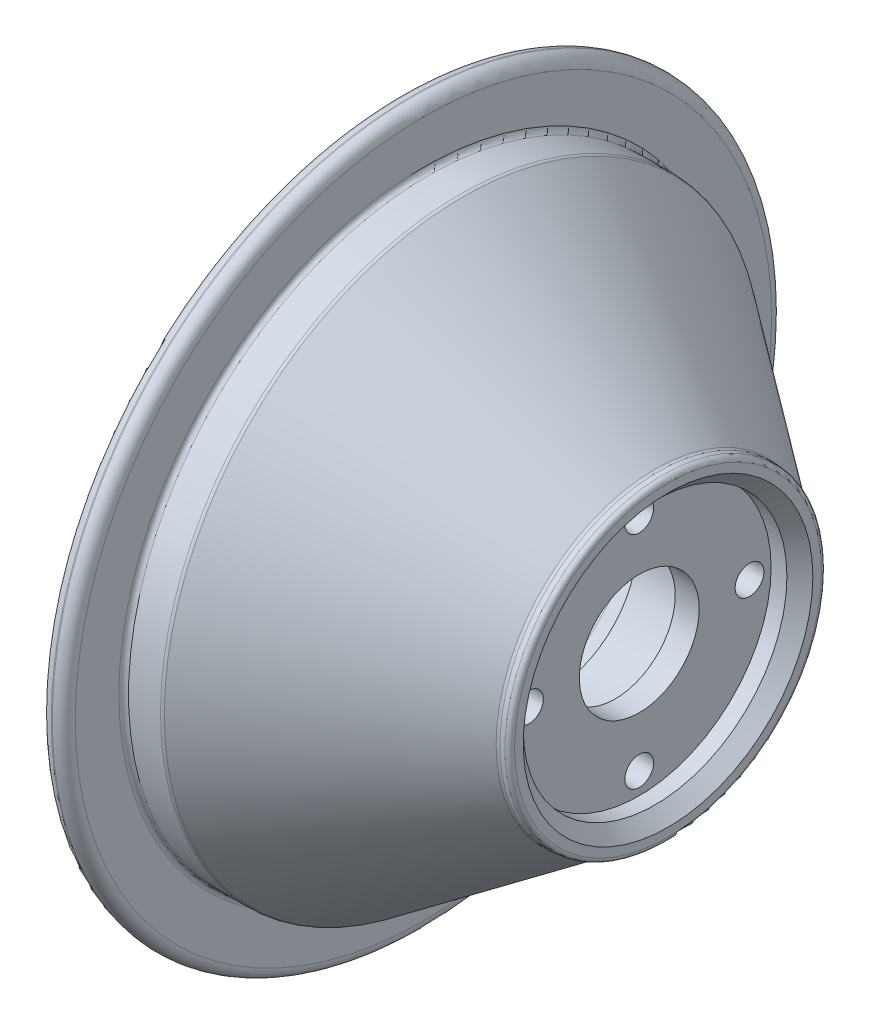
ISO-10303-21;
HEADER;
FILE_DESCRIPTION(('STEP AP214'),'2;1');
FILE_NAME('part.step','',(''),(''),'','','');
FILE_SCHEMA(('AUTOMOTIVE_DESIGN { 1 0 10303 214 1 1 1 1 }'));
ENDSEC;
DATA;
#1=APPLICATION_CONTEXT('core data for automotive mechanical design processes');
#2=APPLICATION_PROTOCOL_DEFINITION('international standard','automotive_design',2000,#1);
#3=PRODUCT_CONTEXT('',#1,'mechanical');
#4=PRODUCT('Part','Part','',(#3));
#5=PRODUCT_RELATED_PRODUCT_CATEGORY('part','',(#4));
#6=PRODUCT_DEFINITION_FORMATION('','',#4);
#7=PRODUCT_DEFINITION_CONTEXT('part definition',#1,'design');
#8=PRODUCT_DEFINITION('design','',#6,#7);
#9=PRODUCT_DEFINITION_SHAPE('','',#8);
#10=(LENGTH_UNIT() NAMED_UNIT(*) SI_UNIT(.MILLI.,.METRE.));
#11=(NAMED_UNIT(*) PLANE_ANGLE_UNIT() SI_UNIT($,.RADIAN.));
#12=(NAMED_UNIT(*) SI_UNIT($,.STERADIAN.) SOLID_ANGLE_UNIT());
#13=UNCERTAINTY_MEASURE_WITH_UNIT(LENGTH_MEASURE(1.E-05),#10,'distance_accuracy_value','');
#14=(GEOMETRIC_REPRESENTATION_CONTEXT(3) GLOBAL_UNCERTAINTY_ASSIGNED_CONTEXT((#13)) GLOBAL_UNIT_ASSIGNED_CONTEXT((#10,
#11,#12)) REPRESENTATION_CONTEXT('',''));
#15=CARTESIAN_POINT('',(0.,0.,0.));
#16=DIRECTION('',(0.,0.,1.));
#17=DIRECTION('',(1.,0.,0.));
#18=AXIS2_PLACEMENT_3D('',#15,#16,#17);
#19=CARTESIAN_POINT('',(0.,0.,0.));
#20=DIRECTION('',(1.,0.,0.));
#21=DIRECTION('',(0.,0.,-1.));
#22=AXIS2_PLACEMENT_3D('',#19,#20,#21);
#23=CYLINDRICAL_SURFACE('',#22,33.);
#24=CARTESIAN_POINT('',(-1.,0.,0.));
#25=DIRECTION('',(1.,0.,0.));
#26=DIRECTION('',(0.,0.,-1.));
#27=AXIS2_PLACEMENT_3D('',#24,#25,#26);
#28=CIRCLE('',#27,33.);
#29=CARTESIAN_POINT('',(-1.,0.,-33.));
#30=VERTEX_POINT('',#29);
#31=EDGE_CURVE('E76',#30,#30,#28,.F.);
#32=ORIENTED_EDGE('',*,*,#31,.T.);
#33=EDGE_LOOP('',(#32));
#34=FACE_BOUND('',#33,.T.);
#35=CARTESIAN_POINT('',(-2.07181364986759,0.,0.));
#36=DIRECTION('',(1.,0.,0.));
#37=DIRECTION('',(0.,0.,-1.));
#38=AXIS2_PLACEMENT_3D('',#35,#36,#37);
#39=CIRCLE('',#38,33.);
#40=CARTESIAN_POINT('',(-2.07181364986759,0.,-33.));
#41=VERTEX_POINT('',#40);
#42=EDGE_CURVE('E79',#41,#41,#39,.T.);
#43=ORIENTED_EDGE('',*,*,#42,.T.);
#44=EDGE_LOOP('',(#43));
#45=FACE_BOUND('',#44,.T.);
#46=ADVANCED_FACE('F30',(#34,#45),#23,.T.);
#47=CARTESIAN_POINT('',(0.,30.2,0.));
#48=DIRECTION('',(1.,0.,0.));
#49=DIRECTION('',(0.,0.,-1.));
#50=AXIS2_PLACEMENT_3D('',#47,#48,#49);
#51=PLANE('',#50);
#52=CARTESIAN_POINT('',(0.,0.,0.));
#53=DIRECTION('',(1.,0.,0.));
#54=DIRECTION('',(0.,0.,-1.));
#55=AXIS2_PLACEMENT_3D('',#52,#53,#54);
#56=CIRCLE('',#55,32.);
#57=CARTESIAN_POINT('',(0.,0.,-32.));
#58=VERTEX_POINT('',#57);
#59=EDGE_CURVE('E82',#58,#58,#56,.T.);
#60=ORIENTED_EDGE('',*,*,#59,.T.);
#61=EDGE_LOOP('',(#60));
#62=FACE_BOUND('',#61,.T.);
#63=CARTESIAN_POINT('',(0.,0.,0.));
#64=DIRECTION('',(1.,0.,0.));
#65=DIRECTION('',(0.,0.,-1.));
#66=AXIS2_PLACEMENT_3D('',#63,#64,#65);
#67=CIRCLE('',#66,30.2);
#68=CARTESIAN_POINT('',(0.,0.,-30.2));
#69=VERTEX_POINT('',#68);
#70=EDGE_CURVE('E97',#69,#69,#67,.T.);
#71=ORIENTED_EDGE('',*,*,#70,.F.);
#72=EDGE_LOOP('',(#71));
#73=FACE_BOUND('',#72,.T.);
#74=ADVANCED_FACE('F208',(#62,#73),#51,.T.);
#75=CARTESIAN_POINT('',(-2.7,0.,0.));
#76=DIRECTION('',(1.,0.,0.));
#77=DIRECTION('',(0.,0.,-1.));
#78=AXIS2_PLACEMENT_3D('',#75,#76,#77);
#79=CONICAL_SURFACE('',#78,27.5,0.78539816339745);
#80=ORIENTED_EDGE('',*,*,#70,.T.);
#81=EDGE_LOOP('',(#80));
#82=FACE_BOUND('',#81,.T.);
#83=CARTESIAN_POINT('',(-2.7,0.,0.));
#84=DIRECTION('',(1.,0.,0.));
#85=DIRECTION('',(0.,0.,-1.));
#86=AXIS2_PLACEMENT_3D('',#83,#84,#85);
#87=CIRCLE('',#86,27.5);
#88=CARTESIAN_POINT('',(-2.7,0.,-27.5));
#89=VERTEX_POINT('',#88);
#90=EDGE_CURVE('E100',#89,#89,#87,.T.);
#91=ORIENTED_EDGE('',*,*,#90,.F.);
#92=EDGE_LOOP('',(#91));
#93=FACE_BOUND('',#92,.T.);
#94=ADVANCED_FACE('F213',(#82,#93),#79,.F.);
#95=CARTESIAN_POINT('',(0.,0.,0.));
#96=DIRECTION('',(1.,0.,0.));
#97=DIRECTION('',(0.,0.,-1.));
#98=AXIS2_PLACEMENT_3D('',#95,#96,#97);
#99=CYLINDRICAL_SURFACE('',#98,27.5);
#100=ORIENTED_EDGE('',*,*,#90,.T.);
#101=EDGE_LOOP('',(#100));
#102=FACE_BOUND('',#101,.T.);
#103=CARTESIAN_POINT('',(-6.,0.,0.));
#104=DIRECTION('',(1.,0.,0.));
#105=DIRECTION('',(0.,0.,-1.));
#106=AXIS2_PLACEMENT_3D('',#103,#104,#105);
#107=CIRCLE('',#106,27.5);
#108=CARTESIAN_POINT('',(-6.,0.,-27.5));
#109=VERTEX_POINT('',#108);
#110=EDGE_CURVE('E103',#109,#109,#107,.T.);
#111=ORIENTED_EDGE('',*,*,#110,.F.);
#112=EDGE_LOOP('',(#111));
#113=FACE_BOUND('',#112,.T.);
#114=ADVANCED_FACE('F343',(#102,#113),#99,.F.);
#115=CARTESIAN_POINT('',(-6.,27.5,0.));
#116=DIRECTION('',(1.,0.,0.));
#117=DIRECTION('',(0.,0.,-1.));
#118=AXIS2_PLACEMENT_3D('',#115,#116,#117);
#119=PLANE('',#118);
#120=CARTESIAN_POINT('',(-6.,2.40912351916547E-13,-23.));
#121=DIRECTION('',(1.,0.,0.));
#122=DIRECTION('',(0.,0.,-1.));
#123=AXIS2_PLACEMENT_3D('',#120,#121,#122);
#124=CIRCLE('',#123,3.);
#125=CARTESIAN_POINT('',(-6.,2.40912351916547E-13,-26.));
#126=VERTEX_POINT('',#125);
#127=EDGE_CURVE('E160',#126,#126,#124,.T.);
#128=ORIENTED_EDGE('',*,*,#127,.F.);
#129=EDGE_LOOP('',(#128));
#130=FACE_BOUND('',#129,.T.);
#131=CARTESIAN_POINT('',(-6.,-23.,-1.60608234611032E-13));
#132=DIRECTION('',(1.,0.,0.));
#133=DIRECTION('',(0.,0.,-1.));
#134=AXIS2_PLACEMENT_3D('',#131,#132,#133);
#135=CIRCLE('',#134,3.);
#136=CARTESIAN_POINT('',(-6.,-23.,-3.00000000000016));
#137=VERTEX_POINT('',#136);
#138=EDGE_CURVE('E154',#137,#137,#135,.T.);
#139=ORIENTED_EDGE('',*,*,#138,.F.);
#140=EDGE_LOOP('',(#139));
#141=FACE_BOUND('',#140,.T.);
#142=CARTESIAN_POINT('',(-6.,0.,23.));
#143=DIRECTION('',(1.,0.,0.));
#144=DIRECTION('',(0.,0.,-1.));
#145=AXIS2_PLACEMENT_3D('',#142,#143,#144);
#146=CIRCLE('',#145,3.);
#147=CARTESIAN_POINT('',(-6.,0.,20.));
#148=VERTEX_POINT('',#147);
#149=EDGE_CURVE('E148',#148,#148,#146,.T.);
#150=ORIENTED_EDGE('',*,*,#149,.F.);
#151=EDGE_LOOP('',(#150));
#152=FACE_BOUND('',#151,.T.);
#153=CARTESIAN_POINT('',(-6.,23.,0.));
#154=DIRECTION('',(1.,0.,0.));
#155=DIRECTION('',(0.,0.,-1.));
#156=AXIS2_PLACEMENT_3D('',#153,#154,#155);
#157=CIRCLE('',#156,3.);
#158=CARTESIAN_POINT('',(-6.,23.,-3.));
#159=VERTEX_POINT('',#158);
#160=EDGE_CURVE('E142',#159,#159,#157,.T.);
#161=ORIENTED_EDGE('',*,*,#160,.F.);
#162=EDGE_LOOP('',(#161));
#163=FACE_BOUND('',#162,.T.);
#164=ORIENTED_EDGE('',*,*,#110,.T.);
#165=EDGE_LOOP('',(#164));
#166=FACE_BOUND('',#165,.T.);
#167=CARTESIAN_POINT('',(-6.,0.,0.));
#168=DIRECTION('',(1.,0.,0.));
#169=DIRECTION('',(0.,0.,-1.));
#170=AXIS2_PLACEMENT_3D('',#167,#168,#169);
#171=CIRCLE('',#170,12.5);
#172=CARTESIAN_POINT('',(-6.,0.,-12.5));
#173=VERTEX_POINT('',#172);
#174=EDGE_CURVE('E106',#173,#173,#171,.T.);
#175=ORIENTED_EDGE('',*,*,#174,.F.);
#176=EDGE_LOOP('',(#175));
#177=FACE_BOUND('',#176,.T.);
#178=ADVANCED_FACE('F340',(#130,#141,#152,#163,#166,#177),#119,.T.);
#179=CARTESIAN_POINT('',(0.,0.,0.));
#180=DIRECTION('',(1.,0.,0.));
#181=DIRECTION('',(0.,0.,-1.));
#182=AXIS2_PLACEMENT_3D('',#179,#180,#181);
#183=CYLINDRICAL_SURFACE('',#182,12.5);
#184=ORIENTED_EDGE('',*,*,#174,.T.);
#185=EDGE_LOOP('',(#184));
#186=FACE_BOUND('',#185,.T.);
#187=CARTESIAN_POINT('',(-11.,0.,0.));
#188=DIRECTION('',(1.,0.,0.));
#189=DIRECTION('',(0.,0.,-1.));
#190=AXIS2_PLACEMENT_3D('',#187,#188,#189);
#191=CIRCLE('',#190,12.5);
#192=CARTESIAN_POINT('',(-11.,0.,-12.5));
#193=VERTEX_POINT('',#192);
#194=EDGE_CURVE('E109',#193,#193,#191,.T.);
#195=ORIENTED_EDGE('',*,*,#194,.F.);
#196=EDGE_LOOP('',(#195));
#197=FACE_BOUND('',#196,.T.);
#198=ADVANCED_FACE('F204',(#186,#197),#183,.F.);
#199=CARTESIAN_POINT('',(-11.,17.5,0.));
#200=DIRECTION('',(-1.,0.,0.));
#201=DIRECTION('',(0.,0.,1.));
#202=AXIS2_PLACEMENT_3D('',#199,#200,#201);
#203=PLANE('',#202);
#204=ORIENTED_EDGE('',*,*,#194,.T.);
#205=EDGE_LOOP('',(#204));
#206=FACE_BOUND('',#205,.T.);
#207=CARTESIAN_POINT('',(-11.,0.,0.));
#208=DIRECTION('',(1.,0.,0.));
#209=DIRECTION('',(0.,0.,-1.));
#210=AXIS2_PLACEMENT_3D('',#207,#208,#209);
#211=CIRCLE('',#210,17.5);
#212=CARTESIAN_POINT('',(-11.,0.,-17.5));
#213=VERTEX_POINT('',#212);
#214=EDGE_CURVE('E112',#213,#213,#211,.T.);
#215=ORIENTED_EDGE('',*,*,#214,.F.);
#216=EDGE_LOOP('',(#215));
#217=FACE_BOUND('',#216,.T.);
#218=ADVANCED_FACE('F198',(#206,#217),#203,.T.);
#219=CARTESIAN_POINT('',(0.,0.,0.));
#220=DIRECTION('',(1.,0.,0.));
#221=DIRECTION('',(0.,0.,-1.));
#222=AXIS2_PLACEMENT_3D('',#219,#220,#221);
#223=CYLINDRICAL_SURFACE('',#222,17.5);
#224=ORIENTED_EDGE('',*,*,#214,.T.);
#225=EDGE_LOOP('',(#224));
#226=FACE_BOUND('',#225,.T.);
#227=CARTESIAN_POINT('',(-24.,0.,0.));
#228=DIRECTION('',(1.,0.,0.));
#229=DIRECTION('',(0.,0.,-1.));
#230=AXIS2_PLACEMENT_3D('',#227,#228,#229);
#231=CIRCLE('',#230,17.5);
#232=CARTESIAN_POINT('',(-24.,0.,-17.5));
#233=VERTEX_POINT('',#232);
#234=EDGE_CURVE('E115',#233,#233,#231,.T.);
#235=ORIENTED_EDGE('',*,*,#234,.F.);
#236=EDGE_LOOP('',(#235));
#237=FACE_BOUND('',#236,.T.);
#238=ADVANCED_FACE('F187',(#226,#237),#223,.F.);
#239=CARTESIAN_POINT('',(-24.,17.5,0.));
#240=DIRECTION('',(-1.,0.,0.));
#241=DIRECTION('',(0.,0.,1.));
#242=AXIS2_PLACEMENT_3D('',#239,#240,#241);
#243=PLANE('',#242);
#244=CARTESIAN_POINT('',(-24.,2.40912351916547E-13,-23.));
#245=DIRECTION('',(-1.,0.,0.));
#246=DIRECTION('',(0.,0.,1.));
#247=AXIS2_PLACEMENT_3D('',#244,#245,#246);
#248=CIRCLE('',#247,4.5);
#249=CARTESIAN_POINT('',(-24.,2.40912351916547E-13,-18.5));
#250=VERTEX_POINT('',#249);
#251=EDGE_CURVE('E139',#250,#250,#248,.T.);
#252=ORIENTED_EDGE('',*,*,#251,.F.);
#253=EDGE_LOOP('',(#252));
#254=FACE_BOUND('',#253,.T.);
#255=CARTESIAN_POINT('',(-24.,-23.,-1.60608234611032E-13));
#256=DIRECTION('',(-1.,0.,0.));
#257=DIRECTION('',(0.,0.,1.));
#258=AXIS2_PLACEMENT_3D('',#255,#256,#257);
#259=CIRCLE('',#258,4.5);
#260=CARTESIAN_POINT('',(-24.,-23.,4.49999999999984));
#261=VERTEX_POINT('',#260);
#262=EDGE_CURVE('E133',#261,#261,#259,.T.);
#263=ORIENTED_EDGE('',*,*,#262,.F.);
#264=EDGE_LOOP('',(#263));
#265=FACE_BOUND('',#264,.T.);
#266=CARTESIAN_POINT('',(-24.,0.,23.));
#267=DIRECTION('',(-1.,0.,0.));
#268=DIRECTION('',(0.,0.,1.));
#269=AXIS2_PLACEMENT_3D('',#266,#267,#268);
#270=CIRCLE('',#269,4.5);
#271=CARTESIAN_POINT('',(-24.,0.,27.5));
#272=VERTEX_POINT('',#271);
#273=EDGE_CURVE('E127',#272,#272,#270,.T.);
#274=ORIENTED_EDGE('',*,*,#273,.F.);
#275=EDGE_LOOP('',(#274));
#276=FACE_BOUND('',#275,.T.);
#277=CARTESIAN_POINT('',(-24.,23.,0.));
#278=DIRECTION('',(-1.,0.,0.));
#279=DIRECTION('',(0.,0.,1.));
#280=AXIS2_PLACEMENT_3D('',#277,#278,#279);
#281=CIRCLE('',#280,4.5);
#282=CARTESIAN_POINT('',(-24.,23.,4.5));
#283=VERTEX_POINT('',#282);
#284=EDGE_CURVE('E121',#283,#283,#281,.T.);
#285=ORIENTED_EDGE('',*,*,#284,.F.);
#286=EDGE_LOOP('',(#285));
#287=FACE_BOUND('',#286,.T.);
#288=CARTESIAN_POINT('',(-24.,0.,0.));
#289=DIRECTION('',(-1.,0.,0.));
#290=DIRECTION('',(0.,0.,1.));
#291=AXIS2_PLACEMENT_3D('',#288,#289,#290);
#292=CIRCLE('',#291,29.572885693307);
#293=CARTESIAN_POINT('',(-24.,0.,29.572885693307));
#294=VERTEX_POINT('',#293);
#295=EDGE_CURVE('E10',#294,#294,#292,.T.);
#296=ORIENTED_EDGE('',*,*,#295,.T.);
#297=EDGE_LOOP('',(#296));
#298=FACE_BOUND('',#297,.T.);
#299=ORIENTED_EDGE('',*,*,#234,.T.);
#300=EDGE_LOOP('',(#299));
#301=FACE_BOUND('',#300,.T.);
#302=ADVANCED_FACE('F183',(#254,#265,#276,#287,#298,#301),#243,.T.);
#303=CARTESIAN_POINT('',(-18.,0.,0.));
#304=DIRECTION('',(1.,0.,0.));
#305=DIRECTION('',(0.,0.,-1.));
#306=AXIS2_PLACEMENT_3D('',#303,#304,#305);
#307=CONICAL_SURFACE('',#306,38.156096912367,0.942477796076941);
#308=CARTESIAN_POINT('',(-18.5877852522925,0.,0.));
#309=DIRECTION('',(1.,0.,0.));
#310=DIRECTION('',(0.,0.,-1.));
#311=AXIS2_PLACEMENT_3D('',#308,#309,#310);
#312=CIRCLE('',#311,37.347079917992);
#313=CARTESIAN_POINT('',(-18.5877852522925,0.,-37.347079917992));
#314=VERTEX_POINT('',#313);
#315=EDGE_CURVE('E36',#314,#314,#312,.F.);
#316=ORIENTED_EDGE('',*,*,#315,.T.);
#317=EDGE_LOOP('',(#316));
#318=FACE_BOUND('',#317,.T.);
#319=CARTESIAN_POINT('',(-23.809016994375,0.,0.));
#320=DIRECTION('',(-1.,0.,0.));
#321=DIRECTION('',(0.,0.,1.));
#322=AXIS2_PLACEMENT_3D('',#319,#320,#321);
#323=CIRCLE('',#322,30.1606709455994);
#324=CARTESIAN_POINT('',(-23.809016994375,0.,30.1606709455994));
#325=VERTEX_POINT('',#324);
#326=EDGE_CURVE('E40',#325,#325,#323,.F.);
#327=ORIENTED_EDGE('',*,*,#326,.T.);
#328=EDGE_LOOP('',(#327));
#329=FACE_BOUND('',#328,.T.);
#330=ADVANCED_FACE('F186',(#318,#329),#307,.T.);
#331=CARTESIAN_POINT('',(-44.6245984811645,0.,0.));
#332=DIRECTION('',(-1.,0.,0.));
#333=DIRECTION('',(0.,0.,1.));
#334=AXIS2_PLACEMENT_3D('',#331,#332,#333);
#335=CONICAL_SURFACE('',#334,57.5,0.62831853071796);
#336=CARTESIAN_POINT('',(-44.361732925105,0.,0.));
#337=DIRECTION('',(-1.,0.,0.));
#338=DIRECTION('',(0.,0.,1.));
#339=AXIS2_PLACEMENT_3D('',#336,#337,#338);
#340=CIRCLE('',#339,57.3090169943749);
#341=CARTESIAN_POINT('',(-44.361732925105,0.,57.3090169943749));
#342=VERTEX_POINT('',#341);
#343=EDGE_CURVE('E52',#342,#342,#340,.T.);
#344=ORIENTED_EDGE('',*,*,#343,.T.);
#345=EDGE_LOOP('',(#344));
#346=FACE_BOUND('',#345,.T.);
#347=CARTESIAN_POINT('',(-18.8090169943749,0.,0.));
#348=DIRECTION('',(-1.,0.,0.));
#349=DIRECTION('',(0.,0.,1.));
#350=AXIS2_PLACEMENT_3D('',#347,#348,#349);
#351=CIRCLE('',#350,38.7438821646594);
#352=CARTESIAN_POINT('',(-18.8090169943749,0.,38.7438821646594));
#353=VERTEX_POINT('',#352);
#354=EDGE_CURVE('E55',#353,#353,#351,.F.);
#355=ORIENTED_EDGE('',*,*,#354,.T.);
#356=EDGE_LOOP('',(#355));
#357=FACE_BOUND('',#356,.T.);
#358=ADVANCED_FACE('F284',(#346,#357),#335,.F.);
#359=CARTESIAN_POINT('',(0.,0.,0.));
#360=DIRECTION('',(1.,0.,0.));
#361=DIRECTION('',(0.,0.,-1.));
#362=AXIS2_PLACEMENT_3D('',#359,#360,#361);
#363=CYLINDRICAL_SURFACE('',#362,57.5);
#364=CARTESIAN_POINT('',(-55.,0.,0.));
#365=DIRECTION('',(-1.,0.,0.));
#366=DIRECTION('',(0.,0.,1.));
#367=AXIS2_PLACEMENT_3D('',#364,#365,#366);
#368=CIRCLE('',#367,57.5);
#369=CARTESIAN_POINT('',(-55.,0.,57.5));
#370=VERTEX_POINT('',#369);
#371=EDGE_CURVE('E58',#370,#370,#368,.T.);
#372=ORIENTED_EDGE('',*,*,#371,.T.);
#373=EDGE_LOOP('',(#372));
#374=FACE_BOUND('',#373,.T.);
#375=CARTESIAN_POINT('',(-44.9495181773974,0.,0.));
#376=DIRECTION('',(1.,0.,0.));
#377=DIRECTION('',(0.,0.,-1.));
#378=AXIS2_PLACEMENT_3D('',#375,#376,#377);
#379=CIRCLE('',#378,57.5);
#380=CARTESIAN_POINT('',(-44.9495181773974,0.,-57.5));
#381=VERTEX_POINT('',#380);
#382=EDGE_CURVE('E61',#381,#381,#379,.T.);
#383=ORIENTED_EDGE('',*,*,#382,.T.);
#384=EDGE_LOOP('',(#383));
#385=FACE_BOUND('',#384,.T.);
#386=ADVANCED_FACE('F280',(#374,#385),#363,.F.);
#387=CARTESIAN_POINT('',(-56.,75.,0.));
#388=DIRECTION('',(-1.,0.,0.));
#389=DIRECTION('',(0.,0.,1.));
#390=AXIS2_PLACEMENT_3D('',#387,#388,#389);
#391=PLANE('',#390);
#392=CARTESIAN_POINT('',(-56.,0.,0.));
#393=DIRECTION('',(-1.,0.,0.));
#394=DIRECTION('',(0.,0.,1.));
#395=AXIS2_PLACEMENT_3D('',#392,#393,#394);
#396=CIRCLE('',#395,58.5);
#397=CARTESIAN_POINT('',(-56.,0.,58.5));
#398=VERTEX_POINT('',#397);
#399=EDGE_CURVE('E64',#398,#398,#396,.F.);
#400=ORIENTED_EDGE('',*,*,#399,.T.);
#401=EDGE_LOOP('',(#400));
#402=FACE_BOUND('',#401,.T.);
#403=CARTESIAN_POINT('',(-56.,0.,0.));
#404=DIRECTION('',(-1.,0.,0.));
#405=DIRECTION('',(0.,0.,1.));
#406=AXIS2_PLACEMENT_3D('',#403,#404,#405);
#407=CIRCLE('',#406,72.6);
#408=CARTESIAN_POINT('',(-56.,0.,72.6));
#409=VERTEX_POINT('',#408);
#410=EDGE_CURVE('E88',#409,#409,#407,.T.);
#411=ORIENTED_EDGE('',*,*,#410,.T.);
#412=EDGE_LOOP('',(#411));
#413=FACE_BOUND('',#412,.T.);
#414=ADVANCED_FACE('F276',(#402,#413),#391,.T.);
#415=CARTESIAN_POINT('',(0.,0.,0.));
#416=DIRECTION('',(1.,0.,0.));
#417=DIRECTION('',(0.,0.,-1.));
#418=AXIS2_PLACEMENT_3D('',#415,#416,#417);
#419=CYLINDRICAL_SURFACE('',#418,75.);
#420=CARTESIAN_POINT('',(-53.6,0.,0.));
#421=DIRECTION('',(-1.,0.,0.));
#422=DIRECTION('',(0.,0.,1.));
#423=AXIS2_PLACEMENT_3D('',#420,#421,#422);
#424=CIRCLE('',#423,75.);
#425=CARTESIAN_POINT('',(-53.6,0.,75.));
#426=VERTEX_POINT('',#425);
#427=EDGE_CURVE('E91',#426,#426,#424,.F.);
#428=ORIENTED_EDGE('',*,*,#427,.T.);
#429=EDGE_LOOP('',(#428));
#430=FACE_BOUND('',#429,.T.);
#431=CARTESIAN_POINT('',(-53.4,0.,0.));
#432=DIRECTION('',(1.,0.,0.));
#433=DIRECTION('',(0.,0.,-1.));
#434=AXIS2_PLACEMENT_3D('',#431,#432,#433);
#435=CIRCLE('',#434,75.);
#436=CARTESIAN_POINT('',(-53.4,0.,-75.));
#437=VERTEX_POINT('',#436);
#438=EDGE_CURVE('E94',#437,#437,#435,.F.);
#439=ORIENTED_EDGE('',*,*,#438,.T.);
#440=EDGE_LOOP('',(#439));
#441=FACE_BOUND('',#440,.T.);
#442=ADVANCED_FACE('F272',(#430,#441),#419,.T.);
#443=CARTESIAN_POINT('',(-51.,62.5,0.));
#444=DIRECTION('',(1.,0.,0.));
#445=DIRECTION('',(0.,0.,-1.));
#446=AXIS2_PLACEMENT_3D('',#443,#444,#445);
#447=PLANE('',#446);
#448=CARTESIAN_POINT('',(-51.,0.,0.));
#449=DIRECTION('',(1.,0.,0.));
#450=DIRECTION('',(0.,0.,-1.));
#451=AXIS2_PLACEMENT_3D('',#448,#449,#450);
#452=CIRCLE('',#451,63.5);
#453=CARTESIAN_POINT('',(-51.,0.,-63.5));
#454=VERTEX_POINT('',#453);
#455=EDGE_CURVE('E67',#454,#454,#452,.F.);
#456=ORIENTED_EDGE('',*,*,#455,.T.);
#457=EDGE_LOOP('',(#456));
#458=FACE_BOUND('',#457,.T.);
#459=CARTESIAN_POINT('',(-51.,0.,0.));
#460=DIRECTION('',(1.,0.,0.));
#461=DIRECTION('',(0.,0.,-1.));
#462=AXIS2_PLACEMENT_3D('',#459,#460,#461);
#463=CIRCLE('',#462,72.6);
#464=CARTESIAN_POINT('',(-51.,0.,-72.6));
#465=VERTEX_POINT('',#464);
#466=EDGE_CURVE('E85',#465,#465,#463,.T.);
#467=ORIENTED_EDGE('',*,*,#466,.T.);
#468=EDGE_LOOP('',(#467));
#469=FACE_BOUND('',#468,.T.);
#470=ADVANCED_FACE('F268',(#458,#469),#447,.T.);
#471=CARTESIAN_POINT('',(0.,0.,0.));
#472=DIRECTION('',(1.,0.,0.));
#473=DIRECTION('',(0.,0.,-1.));
#474=AXIS2_PLACEMENT_3D('',#471,#472,#473);
#475=CYLINDRICAL_SURFACE('',#474,62.5);
#476=CARTESIAN_POINT('',(-50.,0.,0.));
#477=DIRECTION('',(1.,0.,0.));
#478=DIRECTION('',(0.,0.,-1.));
#479=AXIS2_PLACEMENT_3D('',#476,#477,#478);
#480=CIRCLE('',#479,62.5);
#481=CARTESIAN_POINT('',(-50.,0.,-62.5));
#482=VERTEX_POINT('',#481);
#483=EDGE_CURVE('E70',#482,#482,#480,.T.);
#484=ORIENTED_EDGE('',*,*,#483,.T.);
#485=EDGE_LOOP('',(#484));
#486=FACE_BOUND('',#485,.T.);
#487=CARTESIAN_POINT('',(-43.3249196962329,0.,0.));
#488=DIRECTION('',(-1.,0.,0.));
#489=DIRECTION('',(0.,0.,1.));
#490=AXIS2_PLACEMENT_3D('',#487,#488,#489);
#491=CIRCLE('',#490,62.5);
#492=CARTESIAN_POINT('',(-43.3249196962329,0.,62.5));
#493=VERTEX_POINT('',#492);
#494=EDGE_CURVE('E73',#493,#493,#491,.T.);
#495=ORIENTED_EDGE('',*,*,#494,.T.);
#496=EDGE_LOOP('',(#495));
#497=FACE_BOUND('',#496,.T.);
#498=ADVANCED_FACE('F264',(#486,#497),#475,.T.);
#499=CARTESIAN_POINT('',(-2.3967333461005,0.,0.));
#500=DIRECTION('',(-1.,0.,0.));
#501=DIRECTION('',(0.,0.,1.));
#502=AXIS2_PLACEMENT_3D('',#499,#500,#501);
#503=CONICAL_SURFACE('',#502,33.,0.62831853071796);
#504=CARTESIAN_POINT('',(-42.7371344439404,0.,0.));
#505=DIRECTION('',(1.,0.,0.));
#506=DIRECTION('',(0.,0.,-1.));
#507=AXIS2_PLACEMENT_3D('',#504,#505,#506);
#508=CIRCLE('',#507,62.3090169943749);
#509=CARTESIAN_POINT('',(-42.7371344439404,0.,-62.3090169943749));
#510=VERTEX_POINT('',#509);
#511=EDGE_CURVE('E44',#510,#510,#508,.T.);
#512=ORIENTED_EDGE('',*,*,#511,.T.);
#513=EDGE_LOOP('',(#512));
#514=FACE_BOUND('',#513,.T.);
#515=CARTESIAN_POINT('',(-2.65959890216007,0.,0.));
#516=DIRECTION('',(-1.,0.,0.));
#517=DIRECTION('',(0.,0.,1.));
#518=AXIS2_PLACEMENT_3D('',#515,#516,#517);
#519=CIRCLE('',#518,33.1909830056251);
#520=CARTESIAN_POINT('',(-2.65959890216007,0.,33.1909830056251));
#521=VERTEX_POINT('',#520);
#522=EDGE_CURVE('E49',#521,#521,#519,.T.);
#523=ORIENTED_EDGE('',*,*,#522,.T.);
#524=EDGE_LOOP('',(#523));
#525=FACE_BOUND('',#524,.T.);
#526=ADVANCED_FACE('F260',(#514,#525),#503,.T.);
#527=CARTESIAN_POINT('',(-53.6,0.,0.));
#528=DIRECTION('',(-1.,0.,0.));
#529=DIRECTION('',(0.,0.,1.));
#530=AXIS2_PLACEMENT_3D('',#527,#528,#529);
#531=TOROIDAL_SURFACE('',#530,72.6,2.4);
#532=ORIENTED_EDGE('',*,*,#410,.F.);
#533=EDGE_LOOP('',(#532));
#534=FACE_BOUND('',#533,.T.);
#535=ORIENTED_EDGE('',*,*,#427,.F.);
#536=EDGE_LOOP('',(#535));
#537=FACE_BOUND('',#536,.T.);
#538=ADVANCED_FACE('F256',(#534,#537),#531,.T.);
#539=CARTESIAN_POINT('',(-53.4,0.,0.));
#540=DIRECTION('',(1.,0.,0.));
#541=DIRECTION('',(0.,0.,-1.));
#542=AXIS2_PLACEMENT_3D('',#539,#540,#541);
#543=TOROIDAL_SURFACE('',#542,72.6,2.4);
#544=ORIENTED_EDGE('',*,*,#438,.F.);
#545=EDGE_LOOP('',(#544));
#546=FACE_BOUND('',#545,.T.);
#547=ORIENTED_EDGE('',*,*,#466,.F.);
#548=EDGE_LOOP('',(#547));
#549=FACE_BOUND('',#548,.T.);
#550=ADVANCED_FACE('F252',(#546,#549),#543,.T.);
#551=CARTESIAN_POINT('',(-1.,0.,0.));
#552=DIRECTION('',(1.,0.,0.));
#553=DIRECTION('',(0.,0.,-1.));
#554=AXIS2_PLACEMENT_3D('',#551,#552,#553);
#555=TOROIDAL_SURFACE('',#554,32.,1.);
#556=ORIENTED_EDGE('',*,*,#31,.F.);
#557=EDGE_LOOP('',(#556));
#558=FACE_BOUND('',#557,.T.);
#559=ORIENTED_EDGE('',*,*,#59,.F.);
#560=EDGE_LOOP('',(#559));
#561=FACE_BOUND('',#560,.T.);
#562=ADVANCED_FACE('F248',(#558,#561),#555,.T.);
#563=CARTESIAN_POINT('',(-50.,0.,0.));
#564=DIRECTION('',(1.,0.,0.));
#565=DIRECTION('',(0.,0.,-1.));
#566=AXIS2_PLACEMENT_3D('',#563,#564,#565);
#567=TOROIDAL_SURFACE('',#566,63.5,1.);
#568=ORIENTED_EDGE('',*,*,#455,.F.);
#569=EDGE_LOOP('',(#568));
#570=FACE_BOUND('',#569,.T.);
#571=ORIENTED_EDGE('',*,*,#483,.F.);
#572=EDGE_LOOP('',(#571));
#573=FACE_BOUND('',#572,.T.);
#574=ADVANCED_FACE('F244',(#570,#573),#567,.F.);
#575=CARTESIAN_POINT('',(-55.,0.,0.));
#576=DIRECTION('',(-1.,0.,0.));
#577=DIRECTION('',(0.,0.,1.));
#578=AXIS2_PLACEMENT_3D('',#575,#576,#577);
#579=TOROIDAL_SURFACE('',#578,58.5,1.);
#580=ORIENTED_EDGE('',*,*,#371,.F.);
#581=EDGE_LOOP('',(#580));
#582=FACE_BOUND('',#581,.T.);
#583=ORIENTED_EDGE('',*,*,#399,.F.);
#584=EDGE_LOOP('',(#583));
#585=FACE_BOUND('',#584,.T.);
#586=ADVANCED_FACE('F240',(#582,#585),#579,.T.);
#587=CARTESIAN_POINT('',(-44.9495181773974,0.,0.));
#588=DIRECTION('',(1.,0.,0.));
#589=DIRECTION('',(0.,0.,-1.));
#590=AXIS2_PLACEMENT_3D('',#587,#588,#589);
#591=TOROIDAL_SURFACE('',#590,56.5,1.);
#592=ORIENTED_EDGE('',*,*,#343,.F.);
#593=EDGE_LOOP('',(#592));
#594=FACE_BOUND('',#593,.T.);
#595=ORIENTED_EDGE('',*,*,#382,.F.);
#596=EDGE_LOOP('',(#595));
#597=FACE_BOUND('',#596,.T.);
#598=ADVANCED_FACE('F232',(#594,#597),#591,.F.);
#599=CARTESIAN_POINT('',(-43.3249196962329,0.,0.));
#600=DIRECTION('',(-1.,0.,0.));
#601=DIRECTION('',(0.,0.,1.));
#602=AXIS2_PLACEMENT_3D('',#599,#600,#601);
#603=TOROIDAL_SURFACE('',#602,61.5,1.);
#604=ORIENTED_EDGE('',*,*,#494,.F.);
#605=EDGE_LOOP('',(#604));
#606=FACE_BOUND('',#605,.T.);
#607=ORIENTED_EDGE('',*,*,#511,.F.);
#608=EDGE_LOOP('',(#607));
#609=FACE_BOUND('',#608,.T.);
#610=ADVANCED_FACE('F222',(#606,#609),#603,.T.);
#611=CARTESIAN_POINT('',(-2.07181364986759,0.,0.));
#612=DIRECTION('',(1.,0.,0.));
#613=DIRECTION('',(0.,0.,-1.));
#614=AXIS2_PLACEMENT_3D('',#611,#612,#613);
#615=TOROIDAL_SURFACE('',#614,34.,1.);
#616=ORIENTED_EDGE('',*,*,#522,.F.);
#617=EDGE_LOOP('',(#616));
#618=FACE_BOUND('',#617,.T.);
#619=ORIENTED_EDGE('',*,*,#42,.F.);
#620=EDGE_LOOP('',(#619));
#621=FACE_BOUND('',#620,.T.);
#622=ADVANCED_FACE('F219',(#618,#621),#615,.F.);
#623=CARTESIAN_POINT('',(-19.3968022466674,0.,0.));
#624=DIRECTION('',(1.,0.,0.));
#625=DIRECTION('',(0.,0.,-1.));
#626=AXIS2_PLACEMENT_3D('',#623,#624,#625);
#627=TOROIDAL_SURFACE('',#626,37.9348651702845,1.);
#628=ORIENTED_EDGE('',*,*,#315,.F.);
#629=EDGE_LOOP('',(#628));
#630=FACE_BOUND('',#629,.T.);
#631=ORIENTED_EDGE('',*,*,#354,.F.);
#632=EDGE_LOOP('',(#631));
#633=FACE_BOUND('',#632,.T.);
#634=ADVANCED_FACE('F221',(#630,#633),#627,.F.);
#635=CARTESIAN_POINT('',(-23.,0.,0.));
#636=DIRECTION('',(-1.,0.,0.));
#637=DIRECTION('',(0.,0.,1.));
#638=AXIS2_PLACEMENT_3D('',#635,#636,#637);
#639=TOROIDAL_SURFACE('',#638,29.572885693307,1.);
#640=ORIENTED_EDGE('',*,*,#295,.F.);
#641=EDGE_LOOP('',(#640));
#642=FACE_BOUND('',#641,.T.);
#643=ORIENTED_EDGE('',*,*,#326,.F.);
#644=EDGE_LOOP('',(#643));
#645=FACE_BOUND('',#644,.T.);
#646=ADVANCED_FACE('F229',(#642,#645),#639,.T.);
#647=CARTESIAN_POINT('',(-18.,23.,0.));
#648=DIRECTION('',(-1.,0.,0.));
#649=DIRECTION('',(0.,0.,1.));
#650=AXIS2_PLACEMENT_3D('',#647,#648,#649);
#651=CYLINDRICAL_SURFACE('',#650,4.5);
#652=CARTESIAN_POINT('',(-18.,23.,0.));
#653=DIRECTION('',(-1.,0.,0.));
#654=DIRECTION('',(0.,0.,1.));
#655=AXIS2_PLACEMENT_3D('',#652,#653,#654);
#656=CIRCLE('',#655,4.5);
#657=CARTESIAN_POINT('',(-18.,23.,4.5));
#658=VERTEX_POINT('',#657);
#659=EDGE_CURVE('E118',#658,#658,#656,.T.);
#660=ORIENTED_EDGE('',*,*,#659,.F.);
#661=EDGE_LOOP('',(#660));
#662=FACE_BOUND('',#661,.T.);
#663=ORIENTED_EDGE('',*,*,#284,.T.);
#664=EDGE_LOOP('',(#663));
#665=FACE_BOUND('',#664,.T.);
#666=ADVANCED_FACE('F296',(#662,#665),#651,.F.);
#667=CARTESIAN_POINT('',(-18.,23.,0.));
#668=DIRECTION('',(-1.,0.,0.));
#669=DIRECTION('',(0.,0.,1.));
#670=AXIS2_PLACEMENT_3D('',#667,#668,#669);
#671=PLANE('',#670);
#672=CARTESIAN_POINT('',(-18.,23.,0.));
#673=DIRECTION('',(-1.,0.,0.));
#674=DIRECTION('',(0.,0.,1.));
#675=AXIS2_PLACEMENT_3D('',#672,#673,#674);
#676=CIRCLE('',#675,3.);
#677=CARTESIAN_POINT('',(-18.,23.,3.));
#678=VERTEX_POINT('',#677);
#679=EDGE_CURVE('E145',#678,#678,#676,.T.);
#680=ORIENTED_EDGE('',*,*,#679,.F.);
#681=EDGE_LOOP('',(#680));
#682=FACE_BOUND('',#681,.T.);
#683=ORIENTED_EDGE('',*,*,#659,.T.);
#684=EDGE_LOOP('',(#683));
#685=FACE_BOUND('',#684,.T.);
#686=ADVANCED_FACE('F301',(#682,#685),#671,.T.);
#687=CARTESIAN_POINT('',(-18.,0.,23.));
#688=DIRECTION('',(-1.,0.,0.));
#689=DIRECTION('',(0.,0.,1.));
#690=AXIS2_PLACEMENT_3D('',#687,#688,#689);
#691=CYLINDRICAL_SURFACE('',#690,4.5);
#692=CARTESIAN_POINT('',(-18.,0.,23.));
#693=DIRECTION('',(-1.,0.,0.));
#694=DIRECTION('',(0.,0.,1.));
#695=AXIS2_PLACEMENT_3D('',#692,#693,#694);
#696=CIRCLE('',#695,4.5);
#697=CARTESIAN_POINT('',(-18.,0.,27.5));
#698=VERTEX_POINT('',#697);
#699=EDGE_CURVE('E124',#698,#698,#696,.T.);
#700=ORIENTED_EDGE('',*,*,#699,.F.);
#701=EDGE_LOOP('',(#700));
#702=FACE_BOUND('',#701,.T.);
#703=ORIENTED_EDGE('',*,*,#273,.T.);
#704=EDGE_LOOP('',(#703));
#705=FACE_BOUND('',#704,.T.);
#706=ADVANCED_FACE('F307',(#702,#705),#691,.F.);
#707=CARTESIAN_POINT('',(-18.,0.,23.));
#708=DIRECTION('',(-1.,0.,0.));
#709=DIRECTION('',(0.,0.,1.));
#710=AXIS2_PLACEMENT_3D('',#707,#708,#709);
#711=PLANE('',#710);
#712=CARTESIAN_POINT('',(-18.,0.,23.));
#713=DIRECTION('',(-1.,0.,0.));
#714=DIRECTION('',(0.,0.,1.));
#715=AXIS2_PLACEMENT_3D('',#712,#713,#714);
#716=CIRCLE('',#715,3.);
#717=CARTESIAN_POINT('',(-18.,0.,26.));
#718=VERTEX_POINT('',#717);
#719=EDGE_CURVE('E151',#718,#718,#716,.T.);
#720=ORIENTED_EDGE('',*,*,#719,.F.);
#721=EDGE_LOOP('',(#720));
#722=FACE_BOUND('',#721,.T.);
#723=ORIENTED_EDGE('',*,*,#699,.T.);
#724=EDGE_LOOP('',(#723));
#725=FACE_BOUND('',#724,.T.);
#726=ADVANCED_FACE('F311',(#722,#725),#711,.T.);
#727=CARTESIAN_POINT('',(-18.,-23.,-1.60608234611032E-13));
#728=DIRECTION('',(-1.,0.,0.));
#729=DIRECTION('',(0.,0.,1.));
#730=AXIS2_PLACEMENT_3D('',#727,#728,#729);
#731=CYLINDRICAL_SURFACE('',#730,4.5);
#732=CARTESIAN_POINT('',(-18.,-23.,-1.60608234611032E-13));
#733=DIRECTION('',(-1.,0.,0.));
#734=DIRECTION('',(0.,0.,1.));
#735=AXIS2_PLACEMENT_3D('',#732,#733,#734);
#736=CIRCLE('',#735,4.5);
#737=CARTESIAN_POINT('',(-18.,-23.,4.49999999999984));
#738=VERTEX_POINT('',#737);
#739=EDGE_CURVE('E130',#738,#738,#736,.T.);
#740=ORIENTED_EDGE('',*,*,#739,.F.);
#741=EDGE_LOOP('',(#740));
#742=FACE_BOUND('',#741,.T.);
#743=ORIENTED_EDGE('',*,*,#262,.T.);
#744=EDGE_LOOP('',(#743));
#745=FACE_BOUND('',#744,.T.);
#746=ADVANCED_FACE('F315',(#742,#745),#731,.F.);
#747=CARTESIAN_POINT('',(-18.,-23.,-1.60608234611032E-13));
#748=DIRECTION('',(-1.,0.,0.));
#749=DIRECTION('',(0.,0.,1.));
#750=AXIS2_PLACEMENT_3D('',#747,#748,#749);
#751=PLANE('',#750);
#752=CARTESIAN_POINT('',(-18.,-23.,-1.60608234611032E-13));
#753=DIRECTION('',(-1.,0.,0.));
#754=DIRECTION('',(0.,0.,1.));
#755=AXIS2_PLACEMENT_3D('',#752,#753,#754);
#756=CIRCLE('',#755,3.);
#757=CARTESIAN_POINT('',(-18.,-23.,2.99999999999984));
#758=VERTEX_POINT('',#757);
#759=EDGE_CURVE('E157',#758,#758,#756,.T.);
#760=ORIENTED_EDGE('',*,*,#759,.F.);
#761=EDGE_LOOP('',(#760));
#762=FACE_BOUND('',#761,.T.);
#763=ORIENTED_EDGE('',*,*,#739,.T.);
#764=EDGE_LOOP('',(#763));
#765=FACE_BOUND('',#764,.T.);
#766=ADVANCED_FACE('F179',(#762,#765),#751,.T.);
#767=CARTESIAN_POINT('',(-18.,2.40912351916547E-13,-23.));
#768=DIRECTION('',(-1.,0.,0.));
#769=DIRECTION('',(0.,0.,1.));
#770=AXIS2_PLACEMENT_3D('',#767,#768,#769);
#771=CYLINDRICAL_SURFACE('',#770,4.5);
#772=CARTESIAN_POINT('',(-18.,2.40912351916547E-13,-23.));
#773=DIRECTION('',(-1.,0.,0.));
#774=DIRECTION('',(0.,0.,1.));
#775=AXIS2_PLACEMENT_3D('',#772,#773,#774);
#776=CIRCLE('',#775,4.5);
#777=CARTESIAN_POINT('',(-18.,2.40912351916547E-13,-18.5));
#778=VERTEX_POINT('',#777);
#779=EDGE_CURVE('E136',#778,#778,#776,.T.);
#780=ORIENTED_EDGE('',*,*,#779,.F.);
#781=EDGE_LOOP('',(#780));
#782=FACE_BOUND('',#781,.T.);
#783=ORIENTED_EDGE('',*,*,#251,.T.);
#784=EDGE_LOOP('',(#783));
#785=FACE_BOUND('',#784,.T.);
#786=ADVANCED_FACE('F173',(#782,#785),#771,.F.);
#787=CARTESIAN_POINT('',(-18.,2.40912351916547E-13,-23.));
#788=DIRECTION('',(-1.,0.,0.));
#789=DIRECTION('',(0.,0.,1.));
#790=AXIS2_PLACEMENT_3D('',#787,#788,#789);
#791=PLANE('',#790);
#792=CARTESIAN_POINT('',(-18.,2.40912351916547E-13,-23.));
#793=DIRECTION('',(-1.,0.,0.));
#794=DIRECTION('',(0.,0.,1.));
#795=AXIS2_PLACEMENT_3D('',#792,#793,#794);
#796=CIRCLE('',#795,3.);
#797=CARTESIAN_POINT('',(-18.,2.40912351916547E-13,-20.));
#798=VERTEX_POINT('',#797);
#799=EDGE_CURVE('E163',#798,#798,#796,.T.);
#800=ORIENTED_EDGE('',*,*,#799,.F.);
#801=EDGE_LOOP('',(#800));
#802=FACE_BOUND('',#801,.T.);
#803=ORIENTED_EDGE('',*,*,#779,.T.);
#804=EDGE_LOOP('',(#803));
#805=FACE_BOUND('',#804,.T.);
#806=ADVANCED_FACE('F169',(#802,#805),#791,.T.);
#807=CARTESIAN_POINT('',(0.,23.,0.));
#808=DIRECTION('',(-1.,0.,0.));
#809=DIRECTION('',(0.,0.,1.));
#810=AXIS2_PLACEMENT_3D('',#807,#808,#809);
#811=CYLINDRICAL_SURFACE('',#810,3.);
#812=ORIENTED_EDGE('',*,*,#160,.T.);
#813=EDGE_LOOP('',(#812));
#814=FACE_BOUND('',#813,.T.);
#815=ORIENTED_EDGE('',*,*,#679,.T.);
#816=EDGE_LOOP('',(#815));
#817=FACE_BOUND('',#816,.T.);
#818=ADVANCED_FACE('F172',(#814,#817),#811,.F.);
#819=CARTESIAN_POINT('',(0.,0.,23.));
#820=DIRECTION('',(-1.,0.,0.));
#821=DIRECTION('',(0.,0.,1.));
#822=AXIS2_PLACEMENT_3D('',#819,#820,#821);
#823=CYLINDRICAL_SURFACE('',#822,3.);
#824=ORIENTED_EDGE('',*,*,#149,.T.);
#825=EDGE_LOOP('',(#824));
#826=FACE_BOUND('',#825,.T.);
#827=ORIENTED_EDGE('',*,*,#719,.T.);
#828=EDGE_LOOP('',(#827));
#829=FACE_BOUND('',#828,.T.);
#830=ADVANCED_FACE('F325',(#826,#829),#823,.F.);
#831=CARTESIAN_POINT('',(0.,-23.,-1.60608234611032E-13));
#832=DIRECTION('',(-1.,0.,0.));
#833=DIRECTION('',(0.,0.,1.));
#834=AXIS2_PLACEMENT_3D('',#831,#832,#833);
#835=CYLINDRICAL_SURFACE('',#834,3.);
#836=ORIENTED_EDGE('',*,*,#138,.T.);
#837=EDGE_LOOP('',(#836));
#838=FACE_BOUND('',#837,.T.);
#839=ORIENTED_EDGE('',*,*,#759,.T.);
#840=EDGE_LOOP('',(#839));
#841=FACE_BOUND('',#840,.T.);
#842=ADVANCED_FACE('F329',(#838,#841),#835,.F.);
#843=CARTESIAN_POINT('',(0.,2.40912351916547E-13,-23.));
#844=DIRECTION('',(-1.,0.,0.));
#845=DIRECTION('',(0.,0.,1.));
#846=AXIS2_PLACEMENT_3D('',#843,#844,#845);
#847=CYLINDRICAL_SURFACE('',#846,3.);
#848=ORIENTED_EDGE('',*,*,#127,.T.);
#849=EDGE_LOOP('',(#848));
#850=FACE_BOUND('',#849,.T.);
#851=ORIENTED_EDGE('',*,*,#799,.T.);
#852=EDGE_LOOP('',(#851));
#853=FACE_BOUND('',#852,.T.);
#854=ADVANCED_FACE('F167',(#850,#853),#847,.F.);
#855=CLOSED_SHELL('',(#46,#74,#94,#114,#178,#198,#218,#238,#302,#330,#358,#386,#414,#442,#470,
#498,#526,#538,#550,#562,#574,#586,#598,#610,#622,#634,#646,#666,#686,#706,#726,#746,#766,#786,
#806,#818,#830,#842,#854));
#856=MANIFOLD_SOLID_BREP('B2',#855);
#857=ADVANCED_BREP_SHAPE_REPRESENTATION('',(#18,#856),#14);
#858=SHAPE_DEFINITION_REPRESENTATION(#9,#857);
ENDSEC;
END-ISO-10303-21;
